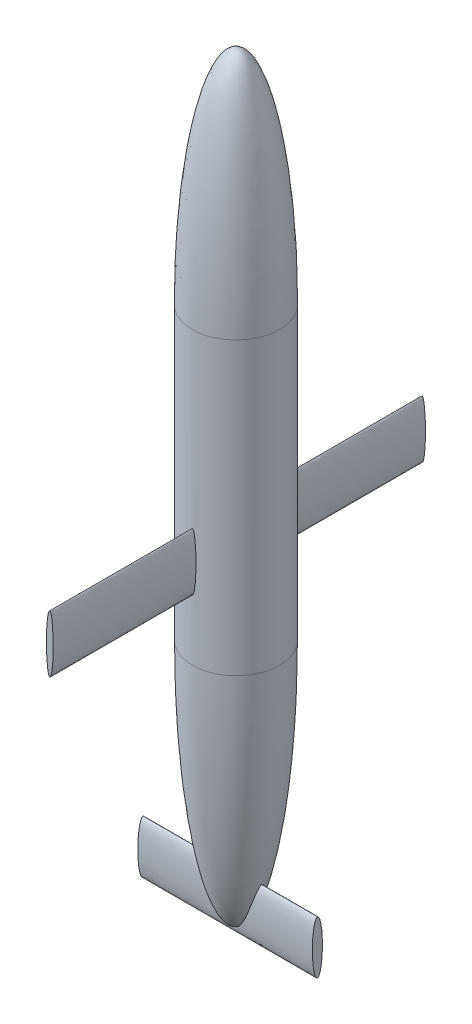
from build123d import *

# Parameters (mm, degrees)
SKETCH2_R           = 149.407975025
BOSS_EXTRUDE1_DEPTH = 1000
SKETCH4_RX          = 98.352642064
SKETCH4_RY          = 11.693399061
BOSS_EXTRUDE2_DEPTH = 500
SKETCH5_RX          = 90.619903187
SKETCH5_RY          = 17.325559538
BOSS_EXTRUDE3_DEPTH = 600


with BuildPart() as part:
    # Sketch1 → Revolve1 (revolve)
    with BuildSketch(Plane.XY, mode=Mode.PRIVATE) as revolve1_sk:
        with BuildLine():
            Line((0, 0), (150, 0))
            add(Edge.make_bspline(
                [(150, 0), (150.098670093, 761.97979376), (0.102650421, 762)],
                knots=[4.712415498, 4.712415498, 4.712415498, 6.283185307, 6.283185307, 6.283185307], degree=2, weights=[1, 0.707116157, 1]))
            Line((0.102650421, 762), (0, 0))
        make_face()
    revolve(revolve1_sk.sketch.rotate(Axis((0.102650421, 762, 0), (-0.00013471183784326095, -0.9999999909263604, 0)), 180), axis=Axis((0.102650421, 762, 0), (-0.00013471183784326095, -0.9999999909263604, 0)))


with BuildPart() as body_2:
    # Sketch2 → Boss-Extrude1 (new body)
    with BuildSketch(Plane(origin=(0, 0, 0), x_dir=(1, 0, 0), z_dir=(0, 1, 0))):
        with Locations(Location((0, 0, 0), (0, 0, 270))):
            Circle(SKETCH2_R)
    extrude(amount=-BOSS_EXTRUDE1_DEPTH)

    # Sketch3 → Revolve2 (revolve)
    with BuildSketch(Plane.XY):
        with BuildLine():
            Line((0, -1846.474744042), (0, -1000))
            Line((0, -1000), (149.407975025, -1000))
            add(Edge.make_bspline(
                [(0, -1846.474744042), (149.407975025, -1846.474744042), (149.407975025, -1000)],
                knots=[3.141592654, 3.141592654, 3.141592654, 4.71238898, 4.71238898, 4.71238898], degree=2, weights=[1, 0.707106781, 1]))
        make_face()
    revolve(axis=Axis((0, -1846.474744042, 0), (0, 1, 0)))

    # Sketch4 → Boss-Extrude2 (add)
    with BuildSketch(Plane.XY.offset(139.999999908)):
        with Locations(Location((0, -691.236333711), (0, 0, 90))):
            Ellipse(SKETCH4_RX, SKETCH4_RY)
    boss_extrude2 = extrude(amount=BOSS_EXTRUDE2_DEPTH)

    # Mirror2: Boss-Extrude2 across plane
    add(boss_extrude2.mirror(Plane.XY))

    # Sketch5 → Boss-Extrude3 (add)
    with BuildSketch(Plane(origin=(280.00000007, 0, 0), x_dir=(0, 0, -1), z_dir=(1, 0, 0))):
        with Locations(Location((0, -1774.543980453), (0, 0, -90))):
            Ellipse(SKETCH5_RX, SKETCH5_RY)
    extrude(amount=-BOSS_EXTRUDE3_DEPTH)


solid = Compound([part.part, body_2.part])
